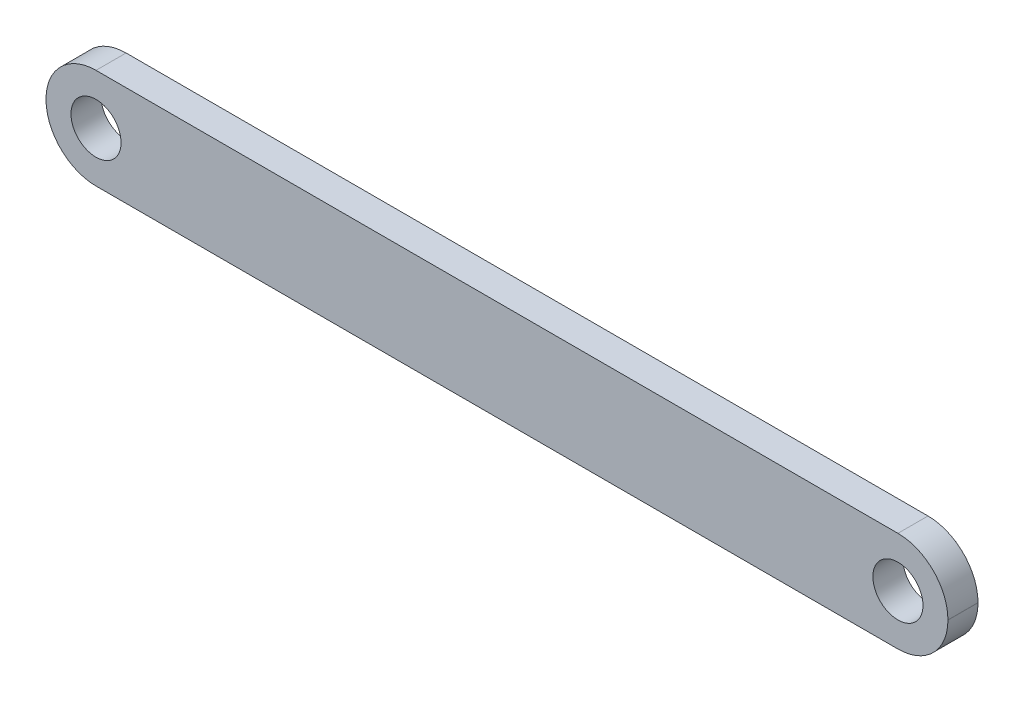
from build123d import *

# Parameters (mm, degrees)
ESQUISSE1_R      = 2.5
EXTRUSION1_DEPTH = 3


with BuildPart() as part:
    # Esquisse1 → Extrusion1 (new body)
    with BuildSketch(Plane.XY):
        with BuildLine():
            Line((-34.963828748, 13.247290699), (45.056171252, 13.247290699))
            ThreePointArc((45.056171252, 13.247290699), (48.58463409, 11.785753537), (50.046171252, 8.257290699))
            Line((50.046171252, 8.257290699), (50.046171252, 8.237290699))
            ThreePointArc((50.046171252, 8.237290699), (48.58463409, 4.708827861), (45.056171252, 3.247290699))
            Line((45.056171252, 3.247290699), (-34.963828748, 3.247290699))
            ThreePointArc((-34.963828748, 3.247290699), (-38.492291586, 4.708827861), (-39.953828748, 8.237290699))
            Line((-39.953828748, 8.237290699), (-39.953828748, 8.257290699))
            ThreePointArc((-39.953828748, 8.257290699), (-38.492291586, 11.785753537), (-34.963828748, 13.247290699))
        make_face()
        with Locations((-34.963828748, 8.237290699)):
            Circle(ESQUISSE1_R, mode=Mode.SUBTRACT)
        with Locations((45.056171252, 8.257290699)):
            Circle(ESQUISSE1_R, mode=Mode.SUBTRACT)
    extrude(amount=EXTRUSION1_DEPTH)


solid = part.part
